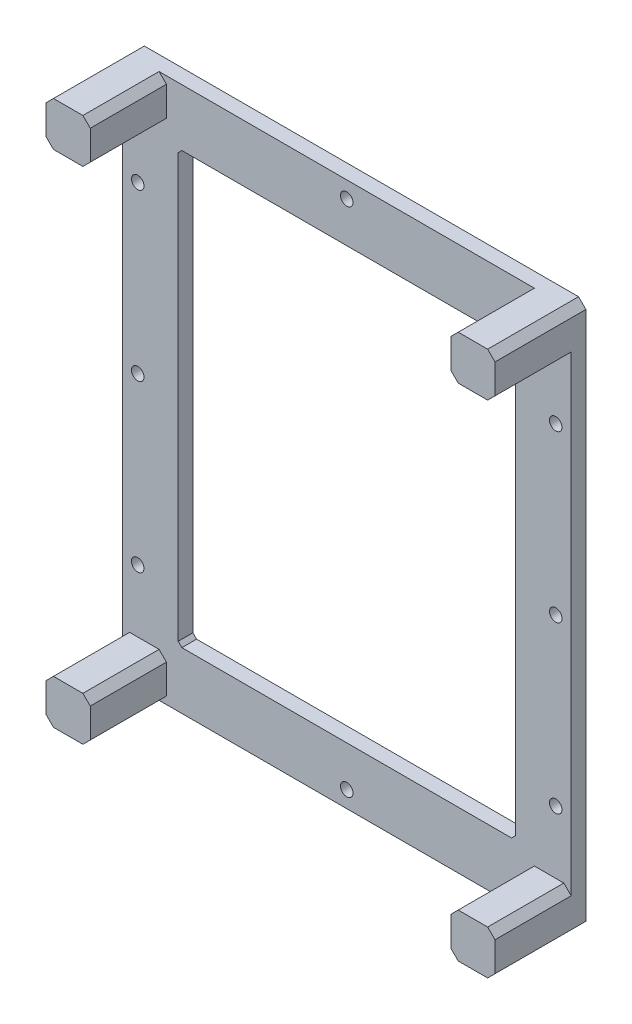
from build123d import *

# Parameters (mm, degrees)
SKETCH_1_R                                     = 1.7
FLAT_RING_8_CLEARANCE_HOLES_OUTSIDE_FILM_DEPTH = 4
FOUR_FIXED_FEET_FILM_PLANE_MATCHES_RECEI_START = 4
FOUR_FIXED_FEET_FILM_PLANE_MATCHES_RECEI_DEPTH = 20.7


with BuildPart() as part:
    # Sketch 1 → Flat_ring_8_clearance_holes_outside_film (new body)
    with BuildSketch(Plane.XY):
        Polygon((-59, -74), (59, -74), (61, -72), (61, 72), (59, 74), (-59, 74), (-61, 72), (-61, -72), align=None)
        with Locations((-56.8, -45)):
            Circle(SKETCH_1_R, mode=Mode.SUBTRACT)
        with Locations((-56.8, 0)):
            Circle(SKETCH_1_R, mode=Mode.SUBTRACT)
        with Locations((-56.8, 45)):
            Circle(SKETCH_1_R, mode=Mode.SUBTRACT)
        with Locations((56.8, -45)):
            Circle(SKETCH_1_R, mode=Mode.SUBTRACT)
        with Locations((56.8, 0)):
            Circle(SKETCH_1_R, mode=Mode.SUBTRACT)
        with Locations((56.8, 45)):
            Circle(SKETCH_1_R, mode=Mode.SUBTRACT)
        with Locations((0, -69.5)):
            Circle(SKETCH_1_R, mode=Mode.SUBTRACT)
        with Locations((0, 69.5)):
            Circle(SKETCH_1_R, mode=Mode.SUBTRACT)
        Polygon((-44.8, -58.5), (44.8, -58.5), (45.8, -57.5), (45.8, 57.5), (44.8, 58.5), (-44.8, 58.5), (-45.8, 57.5), (-45.8, -57.5), align=None, mode=Mode.SUBTRACT)
    extrude(amount=FLAT_RING_8_CLEARANCE_HOLES_OUTSIDE_FILM_DEPTH)

    # Sketch 2 → Four_fixed_feet_film_plane_matches_recei (add)
    with BuildSketch(Plane.XY.offset(FOUR_FIXED_FEET_FILM_PLANE_MATCHES_RECEI_START)):
        Polygon((-59, -74), (-51, -74), (-49, -72), (-49, -64), (-51, -62), (-59, -62), (-61, -64), (-61, -72), align=None)
        Polygon((-59, 62), (-51, 62), (-49, 64), (-49, 72), (-51, 74), (-59, 74), (-61, 72), (-61, 64), align=None)
        Polygon((51, -74), (59, -74), (61, -72), (61, -64), (59, -62), (51, -62), (49, -64), (49, -72), align=None)
        Polygon((51, 62), (59, 62), (61, 64), (61, 72), (59, 74), (51, 74), (49, 72), (49, 64), align=None)
    extrude(amount=FOUR_FIXED_FEET_FILM_PLANE_MATCHES_RECEI_DEPTH)


solid = part.part
